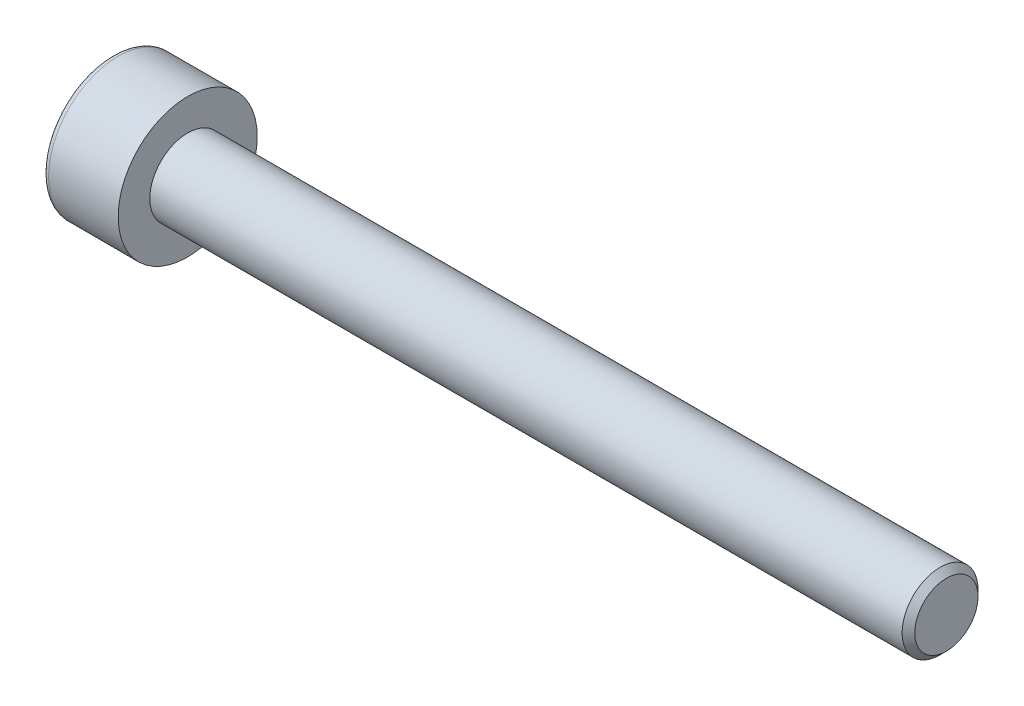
ISO-10303-21;
HEADER;
FILE_DESCRIPTION(('STEP AP214'),'2;1');
FILE_NAME('part.step','',(''),(''),'','','');
FILE_SCHEMA(('AUTOMOTIVE_DESIGN { 1 0 10303 214 1 1 1 1 }'));
ENDSEC;
DATA;
#1=APPLICATION_CONTEXT('core data for automotive mechanical design processes');
#2=APPLICATION_PROTOCOL_DEFINITION('international standard','automotive_design',2000,#1);
#3=PRODUCT_CONTEXT('',#1,'mechanical');
#4=PRODUCT('Part','Part','',(#3));
#5=PRODUCT_RELATED_PRODUCT_CATEGORY('part','',(#4));
#6=PRODUCT_DEFINITION_FORMATION('','',#4);
#7=PRODUCT_DEFINITION_CONTEXT('part definition',#1,'design');
#8=PRODUCT_DEFINITION('design','',#6,#7);
#9=PRODUCT_DEFINITION_SHAPE('','',#8);
#10=(LENGTH_UNIT() NAMED_UNIT(*) SI_UNIT(.MILLI.,.METRE.));
#11=(NAMED_UNIT(*) PLANE_ANGLE_UNIT() SI_UNIT($,.RADIAN.));
#12=(NAMED_UNIT(*) SI_UNIT($,.STERADIAN.) SOLID_ANGLE_UNIT());
#13=UNCERTAINTY_MEASURE_WITH_UNIT(LENGTH_MEASURE(1.E-05),#10,'distance_accuracy_value','');
#14=(GEOMETRIC_REPRESENTATION_CONTEXT(3) GLOBAL_UNCERTAINTY_ASSIGNED_CONTEXT((#13)) GLOBAL_UNIT_ASSIGNED_CONTEXT((#10,
#11,#12)) REPRESENTATION_CONTEXT('',''));
#15=CARTESIAN_POINT('',(0.,0.,0.));
#16=DIRECTION('',(0.,0.,1.));
#17=DIRECTION('',(1.,0.,0.));
#18=AXIS2_PLACEMENT_3D('',#15,#16,#17);
#19=CARTESIAN_POINT('',(12.5013072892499,0.,0.));
#20=DIRECTION('',(1.,0.,0.));
#21=DIRECTION('',(0.,0.,-1.));
#22=AXIS2_PLACEMENT_3D('',#19,#20,#21);
#23=CYLINDRICAL_SURFACE('',#22,1.5);
#24=CARTESIAN_POINT('',(29.75,0.,0.));
#25=DIRECTION('',(1.,0.,0.));
#26=DIRECTION('',(0.,0.,-1.));
#27=AXIS2_PLACEMENT_3D('',#24,#25,#26);
#28=CIRCLE('',#27,1.5);
#29=CARTESIAN_POINT('',(29.75,0.,-1.5));
#30=VERTEX_POINT('',#29);
#31=EDGE_CURVE('E151',#30,#30,#28,.F.);
#32=ORIENTED_EDGE('',*,*,#31,.T.);
#33=EDGE_LOOP('',(#32));
#34=FACE_BOUND('',#33,.T.);
#35=CARTESIAN_POINT('',(0.,0.,0.));
#36=DIRECTION('',(1.,0.,0.));
#37=DIRECTION('',(0.,0.,-1.));
#38=AXIS2_PLACEMENT_3D('',#35,#36,#37);
#39=CIRCLE('',#38,1.5);
#40=CARTESIAN_POINT('',(0.,0.,-1.5));
#41=VERTEX_POINT('',#40);
#42=EDGE_CURVE('E137',#41,#41,#39,.T.);
#43=ORIENTED_EDGE('',*,*,#42,.T.);
#44=EDGE_LOOP('',(#43));
#45=FACE_BOUND('',#44,.T.);
#46=ADVANCED_FACE('F35',(#34,#45),#23,.T.);
#47=CARTESIAN_POINT('',(30.,1.5,0.));
#48=DIRECTION('',(1.,0.,0.));
#49=DIRECTION('',(0.,0.,-1.));
#50=AXIS2_PLACEMENT_3D('',#47,#48,#49);
#51=PLANE('',#50);
#52=CARTESIAN_POINT('',(30.,0.,0.));
#53=DIRECTION('',(1.,0.,0.));
#54=DIRECTION('',(0.,0.,-1.));
#55=AXIS2_PLACEMENT_3D('',#52,#53,#54);
#56=CIRCLE('',#55,1.25);
#57=CARTESIAN_POINT('',(30.,0.,-1.25));
#58=VERTEX_POINT('',#57);
#59=EDGE_CURVE('E148',#58,#58,#56,.T.);
#60=ORIENTED_EDGE('',*,*,#59,.T.);
#61=EDGE_LOOP('',(#60));
#62=FACE_BOUND('',#61,.T.);
#63=ADVANCED_FACE('F173',(#62),#51,.T.);
#64=CARTESIAN_POINT('',(-3.,2.75,0.));
#65=DIRECTION('',(-1.,0.,0.));
#66=DIRECTION('',(0.,0.,1.));
#67=AXIS2_PLACEMENT_3D('',#64,#65,#66);
#68=PLANE('',#67);
#69=DIRECTION('',(0.,0.866025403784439,0.499999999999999));
#70=VECTOR('',#69,1.);
#71=CARTESIAN_POINT('',(-3.,-1.25,0.721687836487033));
#72=LINE('',#71,#70);
#73=CARTESIAN_POINT('',(-3.,-1.25,0.721687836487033));
#74=VERTEX_POINT('',#73);
#75=CARTESIAN_POINT('',(-3.,0.,1.44337567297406));
#76=VERTEX_POINT('',#75);
#77=EDGE_CURVE('E50',#74,#76,#72,.T.);
#78=ORIENTED_EDGE('',*,*,#77,.F.);
#79=DIRECTION('',(0.,0.,1.));
#80=VECTOR('',#79,1.);
#81=CARTESIAN_POINT('',(-3.,-1.25,-0.721687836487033));
#82=LINE('',#81,#80);
#83=CARTESIAN_POINT('',(-3.,-1.25,-0.721687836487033));
#84=VERTEX_POINT('',#83);
#85=EDGE_CURVE('E133',#84,#74,#82,.T.);
#86=ORIENTED_EDGE('',*,*,#85,.F.);
#87=DIRECTION('',(0.,-0.866025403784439,0.5));
#88=VECTOR('',#87,1.);
#89=CARTESIAN_POINT('',(-3.,0.,-1.44337567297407));
#90=LINE('',#89,#88);
#91=CARTESIAN_POINT('',(-3.,0.,-1.44337567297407));
#92=VERTEX_POINT('',#91);
#93=EDGE_CURVE('E131',#92,#84,#90,.T.);
#94=ORIENTED_EDGE('',*,*,#93,.F.);
#95=DIRECTION('',(0.,-0.866025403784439,-0.5));
#96=VECTOR('',#95,1.);
#97=CARTESIAN_POINT('',(-3.,1.25,-0.721687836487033));
#98=LINE('',#97,#96);
#99=CARTESIAN_POINT('',(-3.,1.25,-0.721687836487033));
#100=VERTEX_POINT('',#99);
#101=EDGE_CURVE('E98',#100,#92,#98,.T.);
#102=ORIENTED_EDGE('',*,*,#101,.F.);
#103=DIRECTION('',(0.,0.,-1.));
#104=VECTOR('',#103,1.);
#105=CARTESIAN_POINT('',(-3.,1.25,0.721687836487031));
#106=LINE('',#105,#104);
#107=CARTESIAN_POINT('',(-3.,1.25,0.721687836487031));
#108=VERTEX_POINT('',#107);
#109=EDGE_CURVE('E127',#108,#100,#106,.T.);
#110=ORIENTED_EDGE('',*,*,#109,.F.);
#111=DIRECTION('',(0.,0.866025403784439,-0.5));
#112=VECTOR('',#111,1.);
#113=CARTESIAN_POINT('',(-3.,0.,1.44337567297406));
#114=LINE('',#113,#112);
#115=EDGE_CURVE('E124',#76,#108,#114,.T.);
#116=ORIENTED_EDGE('',*,*,#115,.F.);
#117=EDGE_LOOP('',(#78,#86,#94,#102,#110,#116));
#118=FACE_BOUND('',#117,.T.);
#119=CARTESIAN_POINT('',(-3.,0.,0.));
#120=DIRECTION('',(-1.,0.,0.));
#121=DIRECTION('',(0.,0.,1.));
#122=AXIS2_PLACEMENT_3D('',#119,#120,#121);
#123=CIRCLE('',#122,2.5);
#124=CARTESIAN_POINT('',(-3.,0.,2.5));
#125=VERTEX_POINT('',#124);
#126=EDGE_CURVE('E11',#125,#125,#123,.T.);
#127=ORIENTED_EDGE('',*,*,#126,.T.);
#128=EDGE_LOOP('',(#127));
#129=FACE_BOUND('',#128,.T.);
#130=ADVANCED_FACE('F179',(#118,#129),#68,.T.);
#131=CARTESIAN_POINT('',(12.5013072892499,0.,0.));
#132=DIRECTION('',(1.,0.,0.));
#133=DIRECTION('',(0.,0.,-1.));
#134=AXIS2_PLACEMENT_3D('',#131,#132,#133);
#135=CYLINDRICAL_SURFACE('',#134,2.75);
#136=CARTESIAN_POINT('',(-2.75,0.,0.));
#137=DIRECTION('',(-1.,0.,0.));
#138=DIRECTION('',(0.,0.,1.));
#139=AXIS2_PLACEMENT_3D('',#136,#137,#138);
#140=CIRCLE('',#139,2.75);
#141=CARTESIAN_POINT('',(-2.75,0.,2.75));
#142=VERTEX_POINT('',#141);
#143=EDGE_CURVE('E43',#142,#142,#140,.F.);
#144=ORIENTED_EDGE('',*,*,#143,.T.);
#145=EDGE_LOOP('',(#144));
#146=FACE_BOUND('',#145,.T.);
#147=CARTESIAN_POINT('',(0.,0.,0.));
#148=DIRECTION('',(1.,0.,0.));
#149=DIRECTION('',(0.,0.,-1.));
#150=AXIS2_PLACEMENT_3D('',#147,#148,#149);
#151=CIRCLE('',#150,2.75);
#152=CARTESIAN_POINT('',(0.,0.,-2.75));
#153=VERTEX_POINT('',#152);
#154=EDGE_CURVE('E145',#153,#153,#151,.T.);
#155=ORIENTED_EDGE('',*,*,#154,.F.);
#156=EDGE_LOOP('',(#155));
#157=FACE_BOUND('',#156,.T.);
#158=ADVANCED_FACE('F156',(#146,#157),#135,.T.);
#159=CARTESIAN_POINT('',(0.,1.5,0.));
#160=DIRECTION('',(1.,0.,0.));
#161=DIRECTION('',(0.,0.,-1.));
#162=AXIS2_PLACEMENT_3D('',#159,#160,#161);
#163=PLANE('',#162);
#164=ORIENTED_EDGE('',*,*,#154,.T.);
#165=EDGE_LOOP('',(#164));
#166=FACE_BOUND('',#165,.T.);
#167=ORIENTED_EDGE('',*,*,#42,.F.);
#168=EDGE_LOOP('',(#167));
#169=FACE_BOUND('',#168,.T.);
#170=ADVANCED_FACE('F169',(#166,#169),#163,.T.);
#171=CARTESIAN_POINT('',(30.,0.,0.));
#172=DIRECTION('',(-1.,0.,0.));
#173=DIRECTION('',(0.,0.,1.));
#174=AXIS2_PLACEMENT_3D('',#171,#172,#173);
#175=CONICAL_SURFACE('',#174,1.25,0.785398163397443);
#176=ORIENTED_EDGE('',*,*,#31,.F.);
#177=EDGE_LOOP('',(#176));
#178=FACE_BOUND('',#177,.T.);
#179=ORIENTED_EDGE('',*,*,#59,.F.);
#180=EDGE_LOOP('',(#179));
#181=FACE_BOUND('',#180,.T.);
#182=ADVANCED_FACE('F161',(#178,#181),#175,.T.);
#183=CARTESIAN_POINT('',(-2.75,0.,0.));
#184=DIRECTION('',(-1.,0.,0.));
#185=DIRECTION('',(0.,0.,1.));
#186=AXIS2_PLACEMENT_3D('',#183,#184,#185);
#187=TOROIDAL_SURFACE('',#186,2.5,0.25);
#188=ORIENTED_EDGE('',*,*,#126,.F.);
#189=EDGE_LOOP('',(#188));
#190=FACE_BOUND('',#189,.T.);
#191=ORIENTED_EDGE('',*,*,#143,.F.);
#192=EDGE_LOOP('',(#191));
#193=FACE_BOUND('',#192,.T.);
#194=ADVANCED_FACE('F37',(#190,#193),#187,.T.);
#195=CARTESIAN_POINT('',(-1.3,-1.25,0.721687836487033));
#196=DIRECTION('',(0.,-0.499999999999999,0.866025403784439));
#197=DIRECTION('',(0.,-0.866025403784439,-0.499999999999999));
#198=AXIS2_PLACEMENT_3D('',#195,#196,#197);
#199=PLANE('',#198);
#200=ORIENTED_EDGE('',*,*,#77,.T.);
#201=DIRECTION('',(-1.,0.,0.));
#202=VECTOR('',#201,1.);
#203=CARTESIAN_POINT('',(-1.3,0.,1.44337567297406));
#204=LINE('',#203,#202);
#205=CARTESIAN_POINT('',(-1.3,0.,1.44337567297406));
#206=VERTEX_POINT('',#205);
#207=EDGE_CURVE('E80',#206,#76,#204,.T.);
#208=ORIENTED_EDGE('',*,*,#207,.F.);
#209=DIRECTION('',(0.,0.866025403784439,0.499999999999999));
#210=VECTOR('',#209,1.);
#211=CARTESIAN_POINT('',(-1.3,-1.25,0.721687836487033));
#212=LINE('',#211,#210);
#213=CARTESIAN_POINT('',(-1.3,-1.25,0.721687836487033));
#214=VERTEX_POINT('',#213);
#215=EDGE_CURVE('E135',#214,#206,#212,.T.);
#216=ORIENTED_EDGE('',*,*,#215,.F.);
#217=DIRECTION('',(-1.,0.,0.));
#218=VECTOR('',#217,1.);
#219=CARTESIAN_POINT('',(-1.3,-1.25,0.721687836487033));
#220=LINE('',#219,#218);
#221=EDGE_CURVE('E58',#214,#74,#220,.T.);
#222=ORIENTED_EDGE('',*,*,#221,.T.);
#223=EDGE_LOOP('',(#200,#208,#216,#222));
#224=FACE_BOUND('',#223,.T.);
#225=ADVANCED_FACE('F160',(#224),#199,.F.);
#226=CARTESIAN_POINT('',(-1.3,-1.25,-0.721687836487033));
#227=DIRECTION('',(0.,-1.,0.));
#228=DIRECTION('',(0.,0.,-1.));
#229=AXIS2_PLACEMENT_3D('',#226,#227,#228);
#230=PLANE('',#229);
#231=ORIENTED_EDGE('',*,*,#85,.T.);
#232=ORIENTED_EDGE('',*,*,#221,.F.);
#233=DIRECTION('',(0.,0.,1.));
#234=VECTOR('',#233,1.);
#235=CARTESIAN_POINT('',(-1.3,-1.25,-0.721687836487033));
#236=LINE('',#235,#234);
#237=CARTESIAN_POINT('',(-1.3,-1.25,-0.721687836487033));
#238=VERTEX_POINT('',#237);
#239=EDGE_CURVE('E110',#238,#214,#236,.T.);
#240=ORIENTED_EDGE('',*,*,#239,.F.);
#241=DIRECTION('',(-1.,0.,0.));
#242=VECTOR('',#241,1.);
#243=CARTESIAN_POINT('',(-1.3,-1.25,-0.721687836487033));
#244=LINE('',#243,#242);
#245=EDGE_CURVE('E102',#238,#84,#244,.T.);
#246=ORIENTED_EDGE('',*,*,#245,.T.);
#247=EDGE_LOOP('',(#231,#232,#240,#246));
#248=FACE_BOUND('',#247,.T.);
#249=ADVANCED_FACE('F167',(#248),#230,.F.);
#250=CARTESIAN_POINT('',(-1.3,0.,-1.44337567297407));
#251=DIRECTION('',(0.,-0.5,-0.866025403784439));
#252=DIRECTION('',(0.,0.866025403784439,-0.5));
#253=AXIS2_PLACEMENT_3D('',#250,#251,#252);
#254=PLANE('',#253);
#255=ORIENTED_EDGE('',*,*,#93,.T.);
#256=ORIENTED_EDGE('',*,*,#245,.F.);
#257=DIRECTION('',(0.,-0.866025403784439,0.5));
#258=VECTOR('',#257,1.);
#259=CARTESIAN_POINT('',(-1.3,0.,-1.44337567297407));
#260=LINE('',#259,#258);
#261=CARTESIAN_POINT('',(-1.3,0.,-1.44337567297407));
#262=VERTEX_POINT('',#261);
#263=EDGE_CURVE('E106',#262,#238,#260,.T.);
#264=ORIENTED_EDGE('',*,*,#263,.F.);
#265=DIRECTION('',(-1.,0.,0.));
#266=VECTOR('',#265,1.);
#267=CARTESIAN_POINT('',(-1.3,0.,-1.44337567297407));
#268=LINE('',#267,#266);
#269=EDGE_CURVE('E91',#262,#92,#268,.T.);
#270=ORIENTED_EDGE('',*,*,#269,.T.);
#271=EDGE_LOOP('',(#255,#256,#264,#270));
#272=FACE_BOUND('',#271,.T.);
#273=ADVANCED_FACE('F107',(#272),#254,.F.);
#274=CARTESIAN_POINT('',(-1.3,1.25,-0.721687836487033));
#275=DIRECTION('',(0.,0.5,-0.866025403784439));
#276=DIRECTION('',(0.,0.866025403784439,0.5));
#277=AXIS2_PLACEMENT_3D('',#274,#275,#276);
#278=PLANE('',#277);
#279=ORIENTED_EDGE('',*,*,#101,.T.);
#280=ORIENTED_EDGE('',*,*,#269,.F.);
#281=DIRECTION('',(0.,-0.866025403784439,-0.5));
#282=VECTOR('',#281,1.);
#283=CARTESIAN_POINT('',(-1.3,1.25,-0.721687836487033));
#284=LINE('',#283,#282);
#285=CARTESIAN_POINT('',(-1.3,1.25,-0.721687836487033));
#286=VERTEX_POINT('',#285);
#287=EDGE_CURVE('E95',#286,#262,#284,.T.);
#288=ORIENTED_EDGE('',*,*,#287,.F.);
#289=DIRECTION('',(-1.,0.,0.));
#290=VECTOR('',#289,1.);
#291=CARTESIAN_POINT('',(-1.3,1.25,-0.721687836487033));
#292=LINE('',#291,#290);
#293=EDGE_CURVE('E103',#286,#100,#292,.T.);
#294=ORIENTED_EDGE('',*,*,#293,.T.);
#295=EDGE_LOOP('',(#279,#280,#288,#294));
#296=FACE_BOUND('',#295,.T.);
#297=ADVANCED_FACE('F93',(#296),#278,.F.);
#298=CARTESIAN_POINT('',(-1.3,1.25,0.721687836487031));
#299=DIRECTION('',(0.,1.,0.));
#300=DIRECTION('',(0.,0.,1.));
#301=AXIS2_PLACEMENT_3D('',#298,#299,#300);
#302=PLANE('',#301);
#303=ORIENTED_EDGE('',*,*,#109,.T.);
#304=ORIENTED_EDGE('',*,*,#293,.F.);
#305=DIRECTION('',(0.,0.,-1.));
#306=VECTOR('',#305,1.);
#307=CARTESIAN_POINT('',(-1.3,1.25,0.721687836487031));
#308=LINE('',#307,#306);
#309=CARTESIAN_POINT('',(-1.3,1.25,0.721687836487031));
#310=VERTEX_POINT('',#309);
#311=EDGE_CURVE('E116',#310,#286,#308,.T.);
#312=ORIENTED_EDGE('',*,*,#311,.F.);
#313=DIRECTION('',(-1.,0.,0.));
#314=VECTOR('',#313,1.);
#315=CARTESIAN_POINT('',(-1.3,1.25,0.721687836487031));
#316=LINE('',#315,#314);
#317=EDGE_CURVE('E140',#310,#108,#316,.T.);
#318=ORIENTED_EDGE('',*,*,#317,.T.);
#319=EDGE_LOOP('',(#303,#304,#312,#318));
#320=FACE_BOUND('',#319,.T.);
#321=ADVANCED_FACE('F195',(#320),#302,.F.);
#322=CARTESIAN_POINT('',(-1.3,0.,1.44337567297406));
#323=DIRECTION('',(0.,0.5,0.866025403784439));
#324=DIRECTION('',(0.,-0.866025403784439,0.5));
#325=AXIS2_PLACEMENT_3D('',#322,#323,#324);
#326=PLANE('',#325);
#327=ORIENTED_EDGE('',*,*,#115,.T.);
#328=ORIENTED_EDGE('',*,*,#317,.F.);
#329=DIRECTION('',(0.,0.866025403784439,-0.5));
#330=VECTOR('',#329,1.);
#331=CARTESIAN_POINT('',(-1.3,0.,1.44337567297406));
#332=LINE('',#331,#330);
#333=EDGE_CURVE('E118',#206,#310,#332,.T.);
#334=ORIENTED_EDGE('',*,*,#333,.F.);
#335=ORIENTED_EDGE('',*,*,#207,.T.);
#336=EDGE_LOOP('',(#327,#328,#334,#335));
#337=FACE_BOUND('',#336,.T.);
#338=ADVANCED_FACE('F192',(#337),#326,.F.);
#339=CARTESIAN_POINT('',(-1.3,-1.25,0.721687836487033));
#340=DIRECTION('',(1.,0.,0.));
#341=DIRECTION('',(0.,0.,-1.));
#342=AXIS2_PLACEMENT_3D('',#339,#340,#341);
#343=PLANE('',#342);
#344=ORIENTED_EDGE('',*,*,#215,.T.);
#345=ORIENTED_EDGE('',*,*,#333,.T.);
#346=ORIENTED_EDGE('',*,*,#311,.T.);
#347=ORIENTED_EDGE('',*,*,#287,.T.);
#348=ORIENTED_EDGE('',*,*,#263,.T.);
#349=ORIENTED_EDGE('',*,*,#239,.T.);
#350=EDGE_LOOP('',(#344,#345,#346,#347,#348,#349));
#351=FACE_BOUND('',#350,.T.);
#352=ADVANCED_FACE('F113',(#351),#343,.F.);
#353=CLOSED_SHELL('',(#46,#63,#130,#158,#170,#182,#194,#225,#249,#273,#297,#321,#338,#352));
#354=MANIFOLD_SOLID_BREP('B2',#353);
#355=ADVANCED_BREP_SHAPE_REPRESENTATION('',(#18,#354),#14);
#356=SHAPE_DEFINITION_REPRESENTATION(#9,#355);
ENDSEC;
END-ISO-10303-21;
